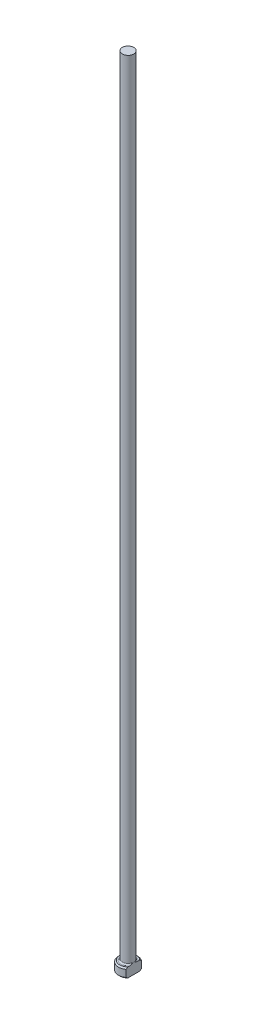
ISO-10303-21;
HEADER;
FILE_DESCRIPTION(('STEP AP214'),'2;1');
FILE_NAME('part.step','',(''),(''),'','','');
FILE_SCHEMA(('AUTOMOTIVE_DESIGN { 1 0 10303 214 1 1 1 1 }'));
ENDSEC;
DATA;
#1=APPLICATION_CONTEXT('core data for automotive mechanical design processes');
#2=APPLICATION_PROTOCOL_DEFINITION('international standard','automotive_design',2000,#1);
#3=PRODUCT_CONTEXT('',#1,'mechanical');
#4=PRODUCT('Part','Part','',(#3));
#5=PRODUCT_RELATED_PRODUCT_CATEGORY('part','',(#4));
#6=PRODUCT_DEFINITION_FORMATION('','',#4);
#7=PRODUCT_DEFINITION_CONTEXT('part definition',#1,'design');
#8=PRODUCT_DEFINITION('design','',#6,#7);
#9=PRODUCT_DEFINITION_SHAPE('','',#8);
#10=(LENGTH_UNIT() NAMED_UNIT(*) SI_UNIT(.MILLI.,.METRE.));
#11=(NAMED_UNIT(*) PLANE_ANGLE_UNIT() SI_UNIT($,.RADIAN.));
#12=(NAMED_UNIT(*) SI_UNIT($,.STERADIAN.) SOLID_ANGLE_UNIT());
#13=UNCERTAINTY_MEASURE_WITH_UNIT(LENGTH_MEASURE(1.E-05),#10,'distance_accuracy_value','');
#14=(GEOMETRIC_REPRESENTATION_CONTEXT(3) GLOBAL_UNCERTAINTY_ASSIGNED_CONTEXT((#13)) GLOBAL_UNIT_ASSIGNED_CONTEXT((#10,
#11,#12)) REPRESENTATION_CONTEXT('',''));
#15=CARTESIAN_POINT('',(0.,0.,0.));
#16=DIRECTION('',(0.,0.,1.));
#17=DIRECTION('',(1.,0.,0.));
#18=AXIS2_PLACEMENT_3D('',#15,#16,#17);
#19=CARTESIAN_POINT('',(0.,0.,0.));
#20=DIRECTION('',(0.,-1.,0.));
#21=DIRECTION('',(0.,0.,-1.));
#22=AXIS2_PLACEMENT_3D('',#19,#20,#21);
#23=PLANE('',#22);
#24=CARTESIAN_POINT('',(0.,0.,0.));
#25=DIRECTION('',(0.,-1.,0.));
#26=DIRECTION('',(0.,0.,-1.));
#27=AXIS2_PLACEMENT_3D('',#24,#25,#26);
#28=CIRCLE('',#27,1.29999999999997);
#29=CARTESIAN_POINT('',(0.899999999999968,0.,0.938083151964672));
#30=VERTEX_POINT('',#29);
#31=CARTESIAN_POINT('',(0.899999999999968,0.,-0.938083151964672));
#32=VERTEX_POINT('',#31);
#33=EDGE_CURVE('E98',#30,#32,#28,.T.);
#34=ORIENTED_EDGE('',*,*,#33,.T.);
#35=DIRECTION('',(0.,0.,1.));
#36=VECTOR('',#35,1.);
#37=CARTESIAN_POINT('',(0.899999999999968,0.,-1.19999999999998));
#38=LINE('',#37,#36);
#39=EDGE_CURVE('E83',#32,#30,#38,.T.);
#40=ORIENTED_EDGE('',*,*,#39,.T.);
#41=EDGE_LOOP('',(#34,#40));
#42=FACE_BOUND('',#41,.T.);
#43=ADVANCED_FACE('F32',(#42),#23,.T.);
#44=CARTESIAN_POINT('',(0.,259.958771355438,0.));
#45=DIRECTION('',(0.,1.,0.));
#46=DIRECTION('',(0.,0.,1.));
#47=AXIS2_PLACEMENT_3D('',#44,#45,#46);
#48=CYLINDRICAL_SURFACE('',#47,1.49999999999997);
#49=CARTESIAN_POINT('',(0.,1.29999999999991,0.));
#50=DIRECTION('',(0.,1.,0.));
#51=DIRECTION('',(0.,0.,1.));
#52=AXIS2_PLACEMENT_3D('',#49,#50,#51);
#53=CIRCLE('',#52,1.49999999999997);
#54=CARTESIAN_POINT('',(0.899999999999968,1.29999999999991,1.19999999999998));
#55=VERTEX_POINT('',#54);
#56=CARTESIAN_POINT('',(0.899999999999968,1.29999999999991,-1.19999999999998));
#57=VERTEX_POINT('',#56);
#58=EDGE_CURVE('E104',#55,#57,#53,.F.);
#59=ORIENTED_EDGE('',*,*,#58,.T.);
#60=DIRECTION('',(0.,-1.,0.));
#61=VECTOR('',#60,1.);
#62=CARTESIAN_POINT('',(0.899999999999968,125.,-1.19999999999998));
#63=LINE('',#62,#61);
#64=CARTESIAN_POINT('',(0.899999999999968,0.200000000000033,-1.19999999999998));
#65=VERTEX_POINT('',#64);
#66=EDGE_CURVE('E183',#57,#65,#63,.T.);
#67=ORIENTED_EDGE('',*,*,#66,.T.);
#68=CARTESIAN_POINT('',(0.,0.200000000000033,0.));
#69=DIRECTION('',(0.,-1.,0.));
#70=DIRECTION('',(0.,0.,-1.));
#71=AXIS2_PLACEMENT_3D('',#68,#69,#70);
#72=CIRCLE('',#71,1.49999999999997);
#73=CARTESIAN_POINT('',(0.899999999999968,0.200000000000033,1.19999999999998));
#74=VERTEX_POINT('',#73);
#75=EDGE_CURVE('E100',#65,#74,#72,.F.);
#76=ORIENTED_EDGE('',*,*,#75,.T.);
#77=DIRECTION('',(0.,-1.,0.));
#78=VECTOR('',#77,1.);
#79=CARTESIAN_POINT('',(0.899999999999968,125.,1.19999999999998));
#80=LINE('',#79,#78);
#81=EDGE_CURVE('E93',#55,#74,#80,.T.);
#82=ORIENTED_EDGE('',*,*,#81,.F.);
#83=EDGE_LOOP('',(#59,#67,#76,#82));
#84=FACE_BOUND('',#83,.T.);
#85=ADVANCED_FACE('F158',(#84),#48,.T.);
#86=CARTESIAN_POINT('',(-1.49999999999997,1.5,0.));
#87=DIRECTION('',(0.,1.,0.));
#88=DIRECTION('',(0.,0.,1.));
#89=AXIS2_PLACEMENT_3D('',#86,#87,#88);
#90=PLANE('',#89);
#91=CARTESIAN_POINT('',(0.,1.5,0.));
#92=DIRECTION('',(0.,1.,0.));
#93=DIRECTION('',(0.,0.,1.));
#94=AXIS2_PLACEMENT_3D('',#91,#92,#93);
#95=CIRCLE('',#94,1.29999999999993);
#96=CARTESIAN_POINT('',(0.899999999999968,1.5,-0.938083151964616));
#97=VERTEX_POINT('',#96);
#98=CARTESIAN_POINT('',(0.899999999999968,1.5,0.938083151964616));
#99=VERTEX_POINT('',#98);
#100=EDGE_CURVE('E178',#97,#99,#95,.T.);
#101=ORIENTED_EDGE('',*,*,#100,.T.);
#102=DIRECTION('',(0.,0.,-1.));
#103=VECTOR('',#102,1.);
#104=CARTESIAN_POINT('',(0.899999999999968,1.5,0.));
#105=LINE('',#104,#103);
#106=CARTESIAN_POINT('',(0.899999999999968,1.49999999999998,0.632455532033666));
#107=VERTEX_POINT('',#106);
#108=EDGE_CURVE('E57',#99,#107,#105,.T.);
#109=ORIENTED_EDGE('',*,*,#108,.T.);
#110=CARTESIAN_POINT('',(0.,1.5,0.));
#111=DIRECTION('',(0.,1.,0.));
#112=DIRECTION('',(0.,0.,1.));
#113=AXIS2_PLACEMENT_3D('',#110,#111,#112);
#114=CIRCLE('',#113,1.09999999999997);
#115=CARTESIAN_POINT('',(0.899999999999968,1.49999999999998,-0.632455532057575));
#116=VERTEX_POINT('',#115);
#117=EDGE_CURVE('E107',#107,#116,#114,.F.);
#118=ORIENTED_EDGE('',*,*,#117,.T.);
#119=EDGE_CURVE('E136',#116,#97,#105,.T.);
#120=ORIENTED_EDGE('',*,*,#119,.T.);
#121=EDGE_LOOP('',(#101,#109,#118,#120));
#122=FACE_BOUND('',#121,.T.);
#123=ADVANCED_FACE('F147',(#122),#90,.T.);
#124=CARTESIAN_POINT('',(0.,1.5,0.));
#125=DIRECTION('',(0.,-1.,0.));
#126=DIRECTION('',(0.,0.,-1.));
#127=AXIS2_PLACEMENT_3D('',#124,#125,#126);
#128=CONICAL_SURFACE('',#127,1.29999999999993,0.785398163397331);
#129=ORIENTED_EDGE('',*,*,#58,.F.);
#130=CARTESIAN_POINT('',(0.899999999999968,0.00589240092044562,2.64519134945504));
#131=CARTESIAN_POINT('',(0.899999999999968,0.0875935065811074,2.55886544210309));
#132=CARTESIAN_POINT('',(0.899999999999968,0.169100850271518,2.47235390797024));
#133=CARTESIAN_POINT('',(0.899999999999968,0.331616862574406,2.29867113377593));
#134=CARTESIAN_POINT('',(0.899999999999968,0.412624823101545,2.21149923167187));
#135=CARTESIAN_POINT('',(0.899999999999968,0.577358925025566,2.03258511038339));
#136=CARTESIAN_POINT('',(0.899999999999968,0.661049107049,1.94080967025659));
#137=CARTESIAN_POINT('',(0.899999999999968,0.827038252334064,1.75619257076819));
#138=CARTESIAN_POINT('',(0.899999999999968,0.909338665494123,1.66335221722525));
#139=CARTESIAN_POINT('',(0.899999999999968,1.07183067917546,1.47606416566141));
#140=CARTESIAN_POINT('',(0.899999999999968,1.15202519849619,1.38161902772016));
#141=CARTESIAN_POINT('',(0.899999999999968,1.26992152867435,1.237694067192));
#142=CARTESIAN_POINT('',(0.899999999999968,1.30888905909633,1.18925359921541));
#143=CARTESIAN_POINT('',(0.899999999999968,1.38565831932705,1.09146009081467));
#144=CARTESIAN_POINT('',(0.899999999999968,1.42346015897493,1.04210713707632));
#145=CARTESIAN_POINT('',(0.899999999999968,1.49668885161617,0.943239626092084));
#146=CARTESIAN_POINT('',(0.899999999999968,1.53214870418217,0.893749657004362));
#147=CARTESIAN_POINT('',(0.899999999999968,1.60090132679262,0.793212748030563));
#148=CARTESIAN_POINT('',(0.899999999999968,1.63419242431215,0.742164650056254));
#149=CARTESIAN_POINT('',(0.899999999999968,1.69733745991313,0.638399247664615));
#150=CARTESIAN_POINT('',(0.899999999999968,1.72721157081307,0.585694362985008));
#151=CARTESIAN_POINT('',(0.899999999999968,1.78207526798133,0.477828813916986));
#152=CARTESIAN_POINT('',(0.899999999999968,1.80707433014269,0.422673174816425));
#153=CARTESIAN_POINT('',(0.899999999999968,1.83835305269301,0.339650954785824));
#154=CARTESIAN_POINT('',(0.899999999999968,1.84751725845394,0.312872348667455));
#155=CARTESIAN_POINT('',(0.899999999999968,1.86390997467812,0.258710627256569));
#156=CARTESIAN_POINT('',(0.899999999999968,1.87113784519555,0.231327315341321));
#157=CARTESIAN_POINT('',(0.899999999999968,1.88330445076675,0.17620583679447));
#158=CARTESIAN_POINT('',(0.899999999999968,1.88825539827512,0.148470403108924));
#159=CARTESIAN_POINT('',(0.899999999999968,1.89566404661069,0.0926697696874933));
#160=CARTESIAN_POINT('',(0.899999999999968,1.89812233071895,0.0646046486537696));
#161=CARTESIAN_POINT('',(0.899999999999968,1.9004068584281,0.00817656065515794));
#162=CARTESIAN_POINT('',(0.899999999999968,1.90021541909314,-0.0201871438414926));
#163=CARTESIAN_POINT('',(0.899999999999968,1.89717544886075,-0.0767648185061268));
#164=CARTESIAN_POINT('',(0.899999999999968,1.89432689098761,-0.104978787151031));
#165=CARTESIAN_POINT('',(0.899999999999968,1.88198440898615,-0.189311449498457));
#166=CARTESIAN_POINT('',(0.899999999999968,1.86868632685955,-0.244892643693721));
#167=CARTESIAN_POINT('',(0.899999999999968,1.83784085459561,-0.342756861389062));
#168=CARTESIAN_POINT('',(0.899999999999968,1.82164970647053,-0.385499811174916));
#169=CARTESIAN_POINT('',(0.899999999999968,1.78562895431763,-0.469449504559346));
#170=CARTESIAN_POINT('',(0.899999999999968,1.76579631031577,-0.510654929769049));
#171=CARTESIAN_POINT('',(0.899999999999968,1.7232927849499,-0.592044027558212));
#172=CARTESIAN_POINT('',(0.899999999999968,1.70059692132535,-0.632214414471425));
#173=CARTESIAN_POINT('',(0.899999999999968,1.65325605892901,-0.711354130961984));
#174=CARTESIAN_POINT('',(0.899999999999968,1.62861192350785,-0.750323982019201));
#175=CARTESIAN_POINT('',(0.899999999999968,1.57369928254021,-0.833637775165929));
#176=CARTESIAN_POINT('',(0.899999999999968,1.5431726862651,-0.877810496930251));
#177=CARTESIAN_POINT('',(0.899999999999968,1.48069350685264,-0.965139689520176));
#178=CARTESIAN_POINT('',(0.899999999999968,1.4487406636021,-1.00829597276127));
#179=CARTESIAN_POINT('',(0.899999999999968,1.35127693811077,-1.13662989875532));
#180=CARTESIAN_POINT('',(0.899999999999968,1.28420052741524,-1.22061473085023));
#181=CARTESIAN_POINT('',(0.899999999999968,1.14740677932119,-1.3868192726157));
#182=CARTESIAN_POINT('',(0.899999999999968,1.07768177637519,-1.46903257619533));
#183=CARTESIAN_POINT('',(0.899999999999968,0.936682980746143,-1.632060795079));
#184=CARTESIAN_POINT('',(0.899999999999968,0.865409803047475,-1.71287624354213));
#185=CARTESIAN_POINT('',(0.899999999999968,0.728966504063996,-1.86553619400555));
#186=CARTESIAN_POINT('',(0.899999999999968,0.66389711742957,-1.93747112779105));
#187=CARTESIAN_POINT('',(0.899999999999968,0.533118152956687,-2.08077158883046));
#188=CARTESIAN_POINT('',(0.899999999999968,0.467408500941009,-2.15213704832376));
#189=CARTESIAN_POINT('',(0.899999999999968,0.335929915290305,-2.29398062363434));
#190=CARTESIAN_POINT('',(0.899999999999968,0.270163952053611,-2.36446149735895));
#191=CARTESIAN_POINT('',(0.899999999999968,0.138274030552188,-2.50506786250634));
#192=CARTESIAN_POINT('',(0.899999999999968,0.0721501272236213,-2.57519340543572));
#193=CARTESIAN_POINT('',(0.899999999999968,0.00589240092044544,-2.64519134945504));
#194=B_SPLINE_CURVE_WITH_KNOTS('',3,(#130,#131,#132,#133,#134,#135,#136,#137,#138,#139,#140,
#141,#142,#143,#144,#145,#146,#147,#148,#149,#150,#151,#152,#153,#154,#155,#156,#157,#158,#159,
#160,#161,#162,#163,#164,#165,#166,#167,#168,#169,#170,#171,#172,#173,#174,#175,#176,#177,#178,
#179,#180,#181,#182,#183,#184,#185,#186,#187,#188,#189,#190,#191,#192,#193),.UNSPECIFIED.,.F.,
.F.,(4,2,2,2,2,2,2,2,2,2,2,2,2,2,2,2,2,2,2,2,2,2,2,2,2,2,2,2,2,2,2,4),(0.,0.356576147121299,
0.713576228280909,1.08618079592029,1.45836906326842,1.83001087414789,2.01650462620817,
2.20298075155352,2.38558873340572,2.56833591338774,2.74994146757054,2.93119042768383,
3.01604159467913,3.10092076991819,3.18533922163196,3.26973791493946,3.3547001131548,
3.43966317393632,3.61026391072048,3.74720161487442,3.8842541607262,4.02259807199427,
4.16088101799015,4.32192495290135,4.48299837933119,4.80535548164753,5.12872978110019,
5.4519778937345,5.7429683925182,6.03399301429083,6.32318782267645,6.61233943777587),.UNSPECIFIED.);
#195=EDGE_CURVE('E135',#55,#99,#194,.T.);
#196=ORIENTED_EDGE('',*,*,#195,.T.);
#197=ORIENTED_EDGE('',*,*,#100,.F.);
#198=EDGE_CURVE('E127',#97,#57,#194,.T.);
#199=ORIENTED_EDGE('',*,*,#198,.T.);
#200=EDGE_LOOP('',(#129,#196,#197,#199));
#201=FACE_BOUND('',#200,.T.);
#202=ADVANCED_FACE('F143',(#201),#128,.T.);
#203=CARTESIAN_POINT('',(0.,0.200000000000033,0.));
#204=DIRECTION('',(0.,1.,0.));
#205=DIRECTION('',(0.,0.,1.));
#206=AXIS2_PLACEMENT_3D('',#203,#204,#205);
#207=CONICAL_SURFACE('',#206,1.49999999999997,0.785398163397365);
#208=ORIENTED_EDGE('',*,*,#75,.F.);
#209=CARTESIAN_POINT('',(0.899999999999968,1.49410759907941,-2.64519134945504));
#210=CARTESIAN_POINT('',(0.899999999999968,1.41240649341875,-2.55886544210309));
#211=CARTESIAN_POINT('',(0.899999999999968,1.33089914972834,-2.47235390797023));
#212=CARTESIAN_POINT('',(0.899999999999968,1.16838313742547,-2.29867113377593));
#213=CARTESIAN_POINT('',(0.899999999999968,1.08737517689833,-2.21149923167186));
#214=CARTESIAN_POINT('',(0.899999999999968,0.922641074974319,-2.03258511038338));
#215=CARTESIAN_POINT('',(0.899999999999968,0.838950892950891,-1.94080967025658));
#216=CARTESIAN_POINT('',(0.899999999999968,0.672961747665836,-1.75619257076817));
#217=CARTESIAN_POINT('',(0.899999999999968,0.590661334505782,-1.66335221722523));
#218=CARTESIAN_POINT('',(0.899999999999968,0.428169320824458,-1.4760641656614));
#219=CARTESIAN_POINT('',(0.899999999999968,0.347974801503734,-1.38161902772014));
#220=CARTESIAN_POINT('',(0.899999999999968,0.230078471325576,-1.23769406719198));
#221=CARTESIAN_POINT('',(0.899999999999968,0.1911109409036,-1.18925359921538));
#222=CARTESIAN_POINT('',(0.899999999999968,0.114341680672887,-1.09146009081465));
#223=CARTESIAN_POINT('',(0.899999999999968,0.0765398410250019,-1.04210713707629));
#224=CARTESIAN_POINT('',(0.899999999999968,0.00331114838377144,-0.943239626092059));
#225=CARTESIAN_POINT('',(0.899999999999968,-0.0321487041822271,-0.893749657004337));
#226=CARTESIAN_POINT('',(0.899999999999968,-0.100901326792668,-0.793212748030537));
#227=CARTESIAN_POINT('',(0.899999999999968,-0.134192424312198,-0.742164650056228));
#228=CARTESIAN_POINT('',(0.899999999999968,-0.197337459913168,-0.638399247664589));
#229=CARTESIAN_POINT('',(0.899999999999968,-0.227211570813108,-0.585694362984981));
#230=CARTESIAN_POINT('',(0.899999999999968,-0.28207526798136,-0.477828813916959));
#231=CARTESIAN_POINT('',(0.899999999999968,-0.307074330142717,-0.422673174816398));
#232=CARTESIAN_POINT('',(0.899999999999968,-0.338353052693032,-0.339650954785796));
#233=CARTESIAN_POINT('',(0.899999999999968,-0.347517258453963,-0.312872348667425));
#234=CARTESIAN_POINT('',(0.899999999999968,-0.363909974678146,-0.258710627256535));
#235=CARTESIAN_POINT('',(0.899999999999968,-0.371137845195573,-0.231327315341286));
#236=CARTESIAN_POINT('',(0.899999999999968,-0.383304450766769,-0.176205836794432));
#237=CARTESIAN_POINT('',(0.899999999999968,-0.388255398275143,-0.148470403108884));
#238=CARTESIAN_POINT('',(0.899999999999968,-0.395664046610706,-0.0926697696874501));
#239=CARTESIAN_POINT('',(0.899999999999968,-0.398122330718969,-0.064604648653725));
#240=CARTESIAN_POINT('',(0.899999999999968,-0.400406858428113,-0.00817656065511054));
#241=CARTESIAN_POINT('',(0.899999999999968,-0.400215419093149,0.0201871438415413));
#242=CARTESIAN_POINT('',(0.899999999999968,-0.397175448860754,0.0767648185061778));
#243=CARTESIAN_POINT('',(0.899999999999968,-0.394326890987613,0.104978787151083));
#244=CARTESIAN_POINT('',(0.899999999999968,-0.381984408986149,0.189311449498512));
#245=CARTESIAN_POINT('',(0.899999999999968,-0.368686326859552,0.244892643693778));
#246=CARTESIAN_POINT('',(0.899999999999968,-0.337840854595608,0.342756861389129));
#247=CARTESIAN_POINT('',(0.899999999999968,-0.321649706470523,0.38549981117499));
#248=CARTESIAN_POINT('',(0.899999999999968,-0.285628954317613,0.469449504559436));
#249=CARTESIAN_POINT('',(0.899999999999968,-0.26579631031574,0.510654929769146));
#250=CARTESIAN_POINT('',(0.899999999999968,-0.22329278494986,0.592044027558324));
#251=CARTESIAN_POINT('',(0.899999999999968,-0.20059692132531,0.632214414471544));
#252=CARTESIAN_POINT('',(0.899999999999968,-0.153256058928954,0.711354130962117));
#253=CARTESIAN_POINT('',(0.899999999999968,-0.128611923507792,0.75032398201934));
#254=CARTESIAN_POINT('',(0.899999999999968,-0.0736992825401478,0.83363777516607));
#255=CARTESIAN_POINT('',(0.899999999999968,-0.0431726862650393,0.877810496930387));
#256=CARTESIAN_POINT('',(0.899999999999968,0.0193064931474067,0.9651396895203));
#257=CARTESIAN_POINT('',(0.899999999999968,0.0512593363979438,1.00829597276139));
#258=CARTESIAN_POINT('',(0.899999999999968,0.148723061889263,1.13662989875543));
#259=CARTESIAN_POINT('',(0.899999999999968,0.215799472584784,1.22061473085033));
#260=CARTESIAN_POINT('',(0.899999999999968,0.352593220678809,1.38681927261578));
#261=CARTESIAN_POINT('',(0.899999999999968,0.422318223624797,1.46903257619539));
#262=CARTESIAN_POINT('',(0.899999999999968,0.563317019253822,1.63206079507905));
#263=CARTESIAN_POINT('',(0.899999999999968,0.634590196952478,1.71287624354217));
#264=CARTESIAN_POINT('',(0.899999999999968,0.771033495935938,1.86553619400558));
#265=CARTESIAN_POINT('',(0.899999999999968,0.836102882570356,1.93747112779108));
#266=CARTESIAN_POINT('',(0.899999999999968,0.966881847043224,2.08077158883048));
#267=CARTESIAN_POINT('',(0.899999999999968,1.0325914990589,2.15213704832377));
#268=CARTESIAN_POINT('',(0.899999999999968,1.16407008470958,2.29398062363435));
#269=CARTESIAN_POINT('',(0.899999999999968,1.22983604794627,2.36446149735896));
#270=CARTESIAN_POINT('',(0.899999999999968,1.36172596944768,2.50506786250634));
#271=CARTESIAN_POINT('',(0.899999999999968,1.42784987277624,2.57519340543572));
#272=CARTESIAN_POINT('',(0.899999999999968,1.49410759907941,2.64519134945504));
#273=B_SPLINE_CURVE_WITH_KNOTS('',3,(#209,#210,#211,#212,#213,#214,#215,#216,#217,#218,#219,
#220,#221,#222,#223,#224,#225,#226,#227,#228,#229,#230,#231,#232,#233,#234,#235,#236,#237,#238,
#239,#240,#241,#242,#243,#244,#245,#246,#247,#248,#249,#250,#251,#252,#253,#254,#255,#256,#257,
#258,#259,#260,#261,#262,#263,#264,#265,#266,#267,#268,#269,#270,#271,#272),.UNSPECIFIED.,.F.,
.F.,(4,2,2,2,2,2,2,2,2,2,2,2,2,2,2,2,2,2,2,2,2,2,2,2,2,2,2,2,2,2,2,4),(0.,0.356576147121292,
0.713576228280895,1.08618079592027,1.45836906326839,1.83001087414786,2.01650462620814,
2.20298075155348,2.38558873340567,2.56833591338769,2.74994146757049,2.93119042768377,
3.01604159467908,3.10092076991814,3.18533922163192,3.26973791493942,3.35470011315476,
3.43966317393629,3.61026391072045,3.74720161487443,3.88425416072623,4.02259807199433,
4.16088101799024,4.32192495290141,4.48299837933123,4.80535548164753,5.12872978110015,
5.45197789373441,5.74296839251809,6.0339930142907,6.3231878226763,6.6123394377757),.UNSPECIFIED.);
#274=EDGE_CURVE('E86',#65,#32,#273,.T.);
#275=ORIENTED_EDGE('',*,*,#274,.T.);
#276=ORIENTED_EDGE('',*,*,#33,.F.);
#277=EDGE_CURVE('E89',#30,#74,#273,.T.);
#278=ORIENTED_EDGE('',*,*,#277,.T.);
#279=EDGE_LOOP('',(#208,#275,#276,#278));
#280=FACE_BOUND('',#279,.T.);
#281=ADVANCED_FACE('F97',(#280),#207,.T.);
#282=CARTESIAN_POINT('',(0.,1.69999999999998,0.));
#283=DIRECTION('',(0.,1.,0.));
#284=DIRECTION('',(0.,0.,1.));
#285=AXIS2_PLACEMENT_3D('',#282,#283,#284);
#286=TOROIDAL_SURFACE('',#285,1.09999999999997,0.2);
#287=CARTESIAN_POINT('',(0.899999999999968,1.69999999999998,0.));
#288=CARTESIAN_POINT('',(0.899999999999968,1.70000051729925,-4.81752855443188E-12));
#289=CARTESIAN_POINT('',(0.899999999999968,1.70000103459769,-8.83853827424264E-08));
#290=CARTESIAN_POINT('',(0.899999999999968,1.70000203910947,-3.79347123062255E-07));
#291=CARTESIAN_POINT('',(0.899999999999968,1.70000252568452,-5.83791020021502E-07));
#292=CARTESIAN_POINT('',(0.899999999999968,1.70000349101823,-1.07888050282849E-06));
#293=CARTESIAN_POINT('',(0.899999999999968,1.70000396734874,-1.37414928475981E-06));
#294=CARTESIAN_POINT('',(0.899999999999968,1.70000487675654,-2.01876645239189E-06));
#295=CARTESIAN_POINT('',(0.899999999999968,1.70000531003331,-2.36784425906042E-06));
#296=CARTESIAN_POINT('',(0.899999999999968,1.70000672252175,-3.59471376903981E-06));
#297=CARTESIAN_POINT('',(0.899999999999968,1.70000764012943,-4.54411385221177E-06));
#298=CARTESIAN_POINT('',(0.899999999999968,1.70000930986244,-6.53225285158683E-06));
#299=CARTESIAN_POINT('',(0.899999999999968,1.70001006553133,-7.56818772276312E-06));
#300=CARTESIAN_POINT('',(0.899999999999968,1.70001280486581,-1.1504277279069E-05));
#301=CARTESIAN_POINT('',(0.899999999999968,1.70001463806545,-1.45126261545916E-05));
#302=CARTESIAN_POINT('',(0.899999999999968,1.70001772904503,-2.0529366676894E-05));
#303=CARTESIAN_POINT('',(0.899999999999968,1.7000190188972,-2.35219566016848E-05));
#304=CARTESIAN_POINT('',(0.899999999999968,1.70002431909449,-3.59579086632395E-05));
#305=CARTESIAN_POINT('',(0.899999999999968,1.70002821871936,-4.5443001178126E-05));
#306=CARTESIAN_POINT('',(0.899999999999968,1.70003465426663,-6.33834857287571E-05));
#307=CARTESIAN_POINT('',(0.899999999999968,1.70003730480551,-7.17963379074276E-05));
#308=CARTESIAN_POINT('',(0.899999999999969,1.7000577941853,-0.000131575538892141));
#309=CARTESIAN_POINT('',(0.899999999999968,1.70008325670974,-0.000179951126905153));
#310=CARTESIAN_POINT('',(0.899999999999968,1.70017756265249,-0.000366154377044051));
#311=CARTESIAN_POINT('',(0.899999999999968,1.70024074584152,-0.000506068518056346));
#312=CARTESIAN_POINT('',(0.899999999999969,1.70048673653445,-0.00104250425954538));
#313=CARTESIAN_POINT('',(0.899999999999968,1.70067547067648,-0.00143687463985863));
#314=CARTESIAN_POINT('',(0.899999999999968,1.70143326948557,-0.00302835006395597));
#315=CARTESIAN_POINT('',(0.899999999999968,1.70199567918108,-0.004227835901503));
#316=CARTESIAN_POINT('',(0.899999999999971,1.71027509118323,-0.0218760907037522));
#317=CARTESIAN_POINT('',(0.899999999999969,1.71804211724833,-0.0383074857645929));
#318=CARTESIAN_POINT('',(0.899999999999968,1.73319280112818,-0.070653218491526));
#319=CARTESIAN_POINT('',(0.899999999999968,1.740580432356,-0.0865658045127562));
#320=CARTESIAN_POINT('',(0.899999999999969,1.75601133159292,-0.120208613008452));
#321=CARTESIAN_POINT('',(0.899999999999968,1.76403763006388,-0.137946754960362));
#322=CARTESIAN_POINT('',(0.899999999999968,1.77987044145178,-0.173723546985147));
#323=CARTESIAN_POINT('',(0.899999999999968,1.78767412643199,-0.19176344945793));
#324=CARTESIAN_POINT('',(0.899999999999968,1.80675241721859,-0.237275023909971));
#325=CARTESIAN_POINT('',(0.899999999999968,1.81776430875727,-0.2648584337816));
#326=CARTESIAN_POINT('',(0.899999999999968,1.83819603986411,-0.319948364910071));
#327=CARTESIAN_POINT('',(0.899999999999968,1.84764487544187,-0.347443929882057));
#328=CARTESIAN_POINT('',(0.899999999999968,1.86148320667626,-0.392411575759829));
#329=CARTESIAN_POINT('',(0.899999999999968,1.86642863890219,-0.409710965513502));
#330=CARTESIAN_POINT('',(0.899999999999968,1.8755120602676,-0.444608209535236));
#331=CARTESIAN_POINT('',(0.899999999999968,1.87964591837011,-0.462207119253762));
#332=CARTESIAN_POINT('',(0.899999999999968,1.89092217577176,-0.517069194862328));
#333=CARTESIAN_POINT('',(0.899999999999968,1.89638973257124,-0.554723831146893));
#334=CARTESIAN_POINT('',(0.899999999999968,1.90033616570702,-0.618345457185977));
#335=CARTESIAN_POINT('',(0.899999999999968,1.90048945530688,-0.644204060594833));
#336=CARTESIAN_POINT('',(0.899999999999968,1.89710720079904,-0.695408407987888));
#337=CARTESIAN_POINT('',(0.899999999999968,1.89361956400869,-0.720756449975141));
#338=CARTESIAN_POINT('',(0.899999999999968,1.8840925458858,-0.761575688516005));
#339=CARTESIAN_POINT('',(0.899999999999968,1.87939871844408,-0.77735842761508));
#340=CARTESIAN_POINT('',(0.899999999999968,1.8677590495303,-0.808125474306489));
#341=CARTESIAN_POINT('',(0.899999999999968,1.86081090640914,-0.82310894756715));
#342=CARTESIAN_POINT('',(0.899999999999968,1.84643118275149,-0.84802158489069));
#343=CARTESIAN_POINT('',(0.899999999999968,1.83956190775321,-0.858273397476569));
#344=CARTESIAN_POINT('',(0.899999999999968,1.82429709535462,-0.877569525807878));
#345=CARTESIAN_POINT('',(0.899999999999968,1.81590447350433,-0.886616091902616));
#346=CARTESIAN_POINT('',(0.899999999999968,1.79958050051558,-0.90122933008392));
#347=CARTESIAN_POINT('',(0.899999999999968,1.79194496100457,-0.907125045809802));
#348=CARTESIAN_POINT('',(0.899999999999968,1.77580769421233,-0.917595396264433));
#349=CARTESIAN_POINT('',(0.899999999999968,1.76730630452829,-0.922170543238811));
#350=CARTESIAN_POINT('',(0.899999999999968,1.74953707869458,-0.929743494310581));
#351=CARTESIAN_POINT('',(0.899999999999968,1.7402636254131,-0.932728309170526));
#352=CARTESIAN_POINT('',(0.899999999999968,1.72131152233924,-0.936825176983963));
#353=CARTESIAN_POINT('',(0.899999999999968,1.71163321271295,-0.937938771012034));
#354=CARTESIAN_POINT('',(0.899999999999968,1.69353224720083,-0.938184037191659));
#355=CARTESIAN_POINT('',(0.899999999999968,1.68511203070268,-0.937557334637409));
#356=CARTESIAN_POINT('',(0.899999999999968,1.66850650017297,-0.934868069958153));
#357=CARTESIAN_POINT('',(0.899999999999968,1.66032116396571,-0.932805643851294));
#358=CARTESIAN_POINT('',(0.899999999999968,1.64454784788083,-0.927423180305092));
#359=CARTESIAN_POINT('',(0.899999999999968,1.63695168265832,-0.924126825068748));
#360=CARTESIAN_POINT('',(0.899999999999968,1.62233604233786,-0.916445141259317));
#361=CARTESIAN_POINT('',(0.899999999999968,1.61531677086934,-0.912059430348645));
#362=CARTESIAN_POINT('',(0.899999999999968,1.59928568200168,-0.90046071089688));
#363=CARTESIAN_POINT('',(0.899999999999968,1.59058572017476,-0.892815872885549));
#364=CARTESIAN_POINT('',(0.899999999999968,1.5745385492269,-0.876213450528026));
#365=CARTESIAN_POINT('',(0.899999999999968,1.56719456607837,-0.867252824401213));
#366=CARTESIAN_POINT('',(0.899999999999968,1.55118133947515,-0.84466452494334));
#367=CARTESIAN_POINT('',(0.899999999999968,1.54313909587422,-0.830593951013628));
#368=CARTESIAN_POINT('',(0.899999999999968,1.52938683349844,-0.801407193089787));
#369=CARTESIAN_POINT('',(0.899999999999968,1.5236756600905,-0.786291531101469));
#370=CARTESIAN_POINT('',(0.899999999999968,1.51172911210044,-0.74718638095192));
#371=CARTESIAN_POINT('',(0.899999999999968,1.50685445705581,-0.722784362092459));
#372=CARTESIAN_POINT('',(0.899999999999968,1.50081074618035,-0.673272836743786));
#373=CARTESIAN_POINT('',(0.899999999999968,1.49969151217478,-0.648158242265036));
#374=CARTESIAN_POINT('',(0.899999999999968,1.50075906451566,-0.577783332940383));
#375=CARTESIAN_POINT('',(0.899999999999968,1.50633248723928,-0.532580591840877));
#376=CARTESIAN_POINT('',(0.899999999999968,1.51921661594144,-0.466989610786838));
#377=CARTESIAN_POINT('',(0.899999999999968,1.52408424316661,-0.446017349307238));
#378=CARTESIAN_POINT('',(0.899999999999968,1.53497010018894,-0.404492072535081));
#379=CARTESIAN_POINT('',(0.899999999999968,1.54098157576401,-0.383937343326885));
#380=CARTESIAN_POINT('',(0.899999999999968,1.55597324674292,-0.336733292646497));
#381=CARTESIAN_POINT('',(0.899999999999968,1.56529325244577,-0.31019400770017));
#382=CARTESIAN_POINT('',(0.899999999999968,1.58534056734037,-0.256981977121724));
#383=CARTESIAN_POINT('',(0.899999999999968,1.59609461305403,-0.230319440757));
#384=CARTESIAN_POINT('',(0.899999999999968,1.61469335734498,-0.186260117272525));
#385=CARTESIAN_POINT('',(0.899999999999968,1.62230075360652,-0.168761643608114));
#386=CARTESIAN_POINT('',(0.899999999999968,1.63771739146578,-0.134051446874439));
#387=CARTESIAN_POINT('',(0.899999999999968,1.64552404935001,-0.11683857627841));
#388=CARTESIAN_POINT('',(0.899999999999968,1.66052241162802,-0.0841876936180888));
#389=CARTESIAN_POINT('',(0.899999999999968,1.66769861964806,-0.068742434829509));
#390=CARTESIAN_POINT('',(0.899999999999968,1.68241091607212,-0.0373451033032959));
#391=CARTESIAN_POINT('',(0.899999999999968,1.68995069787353,-0.0213946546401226));
#392=CARTESIAN_POINT('',(0.899999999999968,1.69800429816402,-0.00422789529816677));
#393=CARTESIAN_POINT('',(0.899999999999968,1.6985666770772,-0.00302846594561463));
#394=CARTESIAN_POINT('',(0.899999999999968,1.69932446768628,-0.00143700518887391));
#395=CARTESIAN_POINT('',(0.899999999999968,1.69951322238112,-0.001042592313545));
#396=CARTESIAN_POINT('',(0.899999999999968,1.69975923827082,-0.0005061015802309));
#397=CARTESIAN_POINT('',(0.899999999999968,1.69982242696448,-0.00036617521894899));
#398=CARTESIAN_POINT('',(0.899999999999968,1.69991674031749,-0.000179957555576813));
#399=CARTESIAN_POINT('',(0.899999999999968,1.69994220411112,-0.000131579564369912));
#400=CARTESIAN_POINT('',(0.899999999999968,1.69996269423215,-7.17975508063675E-05));
#401=CARTESIAN_POINT('',(0.899999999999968,1.69996534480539,-6.33844949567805E-05));
#402=CARTESIAN_POINT('',(0.899999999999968,1.69997178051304,-4.54435728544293E-05));
#403=CARTESIAN_POINT('',(0.899999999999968,1.69997568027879,-3.59582518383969E-05));
#404=CARTESIAN_POINT('',(0.899999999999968,1.69998098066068,-2.35220424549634E-05));
#405=CARTESIAN_POINT('',(0.899999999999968,1.69998227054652,-2.05294182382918E-05));
#406=CARTESIAN_POINT('',(0.899999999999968,1.69998536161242,-1.45126147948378E-05));
#407=CARTESIAN_POINT('',(0.899999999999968,1.69998719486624,-1.15042383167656E-05));
#408=CARTESIAN_POINT('',(0.899999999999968,1.69998993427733,-7.56812363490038E-06));
#409=CARTESIAN_POINT('',(0.899999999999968,1.69999068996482,-6.53218593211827E-06));
#410=CARTESIAN_POINT('',(0.899999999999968,1.69999235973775,-4.54404507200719E-06));
#411=CARTESIAN_POINT('',(0.899999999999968,1.69999327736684,-3.59464609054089E-06));
#412=CARTESIAN_POINT('',(0.899999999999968,1.69999468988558,-2.367782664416E-06));
#413=CARTESIAN_POINT('',(0.899999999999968,1.69999512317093,-2.0187075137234E-06));
#414=CARTESIAN_POINT('',(0.899999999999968,1.6999960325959,-1.37409717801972E-06));
#415=CARTESIAN_POINT('',(0.899999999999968,1.69999650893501,-1.07883258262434E-06));
#416=CARTESIAN_POINT('',(0.899999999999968,1.69999747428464,-5.83753284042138E-07));
#417=CARTESIAN_POINT('',(0.899999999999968,1.69999796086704,-3.79315230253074E-07));
#418=CARTESIAN_POINT('',(0.899999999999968,1.69999896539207,-8.83675723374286E-08));
#419=CARTESIAN_POINT('',(0.899999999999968,1.69999948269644,4.81756834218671E-12));
#420=CARTESIAN_POINT('',(0.899999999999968,1.69999999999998,0.));
#421=B_SPLINE_CURVE_WITH_KNOTS('',3,(#287,#288,#289,#290,#291,#292,#293,#294,#295,#296,#297,
#298,#299,#300,#301,#302,#303,#304,#305,#306,#307,#308,#309,#310,#311,#312,#313,#314,#315,#316,
#317,#318,#319,#320,#321,#322,#323,#324,#325,#326,#327,#328,#329,#330,#331,#332,#333,#334,#335,
#336,#337,#338,#339,#340,#341,#342,#343,#344,#345,#346,#347,#348,#349,#350,#351,#352,#353,#354,
#355,#356,#357,#358,#359,#360,#361,#362,#363,#364,#365,#366,#367,#368,#369,#370,#371,#372,#373,
#374,#375,#376,#377,#378,#379,#380,#381,#382,#383,#384,#385,#386,#387,#388,#389,#390,#391,#392,
#393,#394,#395,#396,#397,#398,#399,#400,#401,#402,#403,#404,#405,#406,#407,#408,#409,#410,#411,
#412,#413,#414,#415,#416,#417,#418,#419,#420),.UNSPECIFIED.,.T.,.F.,(4,2,2,2,2,2,2,2,2,2,2,2,2,
2,2,2,2,2,2,2,2,2,2,2,2,2,2,2,2,2,2,2,2,2,2,2,2,2,2,2,2,2,2,2,2,2,2,2,2,2,2,2,2,2,2,2,2,2,2,2,2,
2,2,2,2,2,4),(0.,1.55029814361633E-06,3.12621066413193E-06,4.80150809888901E-06,
6.46864070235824E-06,1.04101337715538E-05,1.42537471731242E-05,2.4783374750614E-05,
3.45499426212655E-05,6.53057747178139E-05,9.17408886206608E-05,0.000254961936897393,
0.000716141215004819,0.00202698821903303,0.00600215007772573,0.0605188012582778,
0.113151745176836,0.171557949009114,0.230521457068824,0.319597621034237,0.406770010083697,
0.460726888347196,0.514951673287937,0.628665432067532,0.706058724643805,0.782446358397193,
0.831714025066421,0.881032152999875,0.917931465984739,0.954760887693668,0.983590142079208,
1.01240819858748,1.04145815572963,1.07048417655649,1.09568882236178,1.12089108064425,
1.14563256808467,1.17038275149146,1.20493518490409,1.23956879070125,1.28791845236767,
1.33624413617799,1.41048010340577,1.485697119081,1.6214638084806,1.68604551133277,1.75025708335,
1.83460395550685,1.92083077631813,1.97807032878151,2.03476947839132,2.08586372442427,
2.13878481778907,2.14275978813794,2.14407077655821,2.14453199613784,2.14469522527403,
2.14472166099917,2.14475241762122,2.14476218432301,2.14477271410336,2.14477655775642,
2.14478049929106,2.14478216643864,2.14478384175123,2.1447854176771,2.14478696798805),.UNSPECIFIED.);
#422=CARTESIAN_POINT('',(0.899999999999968,1.69999999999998,0.));
#423=VERTEX_POINT('',#422);
#424=EDGE_CURVE('E11',#116,#423,#421,.T.);
#425=ORIENTED_EDGE('',*,*,#424,.F.);
#426=ORIENTED_EDGE('',*,*,#117,.F.);
#427=CARTESIAN_POINT('',(0.899999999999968,1.69999999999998,0.));
#428=CARTESIAN_POINT('',(0.899999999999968,1.69999948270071,4.81751337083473E-12));
#429=CARTESIAN_POINT('',(0.899999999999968,1.69999896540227,8.8385382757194E-08));
#430=CARTESIAN_POINT('',(0.899999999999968,1.69999796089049,3.79347123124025E-07));
#431=CARTESIAN_POINT('',(0.899999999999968,1.69999747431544,5.83791020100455E-07));
#432=CARTESIAN_POINT('',(0.899999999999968,1.69999650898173,1.07888050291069E-06));
#433=CARTESIAN_POINT('',(0.899999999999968,1.69999603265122,1.3741492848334E-06));
#434=CARTESIAN_POINT('',(0.899999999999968,1.69999512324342,2.01876645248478E-06));
#435=CARTESIAN_POINT('',(0.899999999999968,1.69999468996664,2.36784425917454E-06));
#436=CARTESIAN_POINT('',(0.899999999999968,1.69999327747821,3.59471376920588E-06));
#437=CARTESIAN_POINT('',(0.899999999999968,1.69999235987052,4.54411385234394E-06));
#438=CARTESIAN_POINT('',(0.899999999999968,1.69999069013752,6.53225285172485E-06));
#439=CARTESIAN_POINT('',(0.899999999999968,1.69998993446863,7.5681877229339E-06));
#440=CARTESIAN_POINT('',(0.899999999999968,1.69998719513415,1.15042772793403E-05));
#441=CARTESIAN_POINT('',(0.899999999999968,1.69998536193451,1.45126261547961E-05));
#442=CARTESIAN_POINT('',(0.899999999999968,1.69998227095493,2.05293666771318E-05));
#443=CARTESIAN_POINT('',(0.899999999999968,1.69998098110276,2.35219566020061E-05));
#444=CARTESIAN_POINT('',(0.899999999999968,1.69997568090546,3.59579086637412E-05));
#445=CARTESIAN_POINT('',(0.899999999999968,1.6999717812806,4.54430011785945E-05));
#446=CARTESIAN_POINT('',(0.899999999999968,1.69996534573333,6.33834857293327E-05));
#447=CARTESIAN_POINT('',(0.899999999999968,1.69996269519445,7.17963379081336E-05));
#448=CARTESIAN_POINT('',(0.899999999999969,1.69994220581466,0.000131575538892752));
#449=CARTESIAN_POINT('',(0.899999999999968,1.69991674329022,0.000179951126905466));
#450=CARTESIAN_POINT('',(0.899999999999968,1.69982243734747,0.000366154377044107));
#451=CARTESIAN_POINT('',(0.899999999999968,1.69975925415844,0.000506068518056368));
#452=CARTESIAN_POINT('',(0.899999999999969,1.69951326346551,0.00104250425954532));
#453=CARTESIAN_POINT('',(0.899999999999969,1.69932452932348,0.00143687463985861));
#454=CARTESIAN_POINT('',(0.899999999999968,1.69856673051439,0.00302835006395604));
#455=CARTESIAN_POINT('',(0.899999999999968,1.69800432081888,0.00422783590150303));
#456=CARTESIAN_POINT('',(0.899999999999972,1.68972490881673,0.0218760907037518));
#457=CARTESIAN_POINT('',(0.899999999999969,1.68195788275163,0.0383074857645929));
#458=CARTESIAN_POINT('',(0.899999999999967,1.66680719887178,0.0706532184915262));
#459=CARTESIAN_POINT('',(0.899999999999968,1.65941956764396,0.0865658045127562));
#460=CARTESIAN_POINT('',(0.899999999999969,1.64398866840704,0.120208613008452));
#461=CARTESIAN_POINT('',(0.899999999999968,1.63596236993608,0.137946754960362));
#462=CARTESIAN_POINT('',(0.899999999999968,1.62012955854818,0.173723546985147));
#463=CARTESIAN_POINT('',(0.899999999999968,1.61232587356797,0.19176344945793));
#464=CARTESIAN_POINT('',(0.899999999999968,1.59324758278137,0.237275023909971));
#465=CARTESIAN_POINT('',(0.899999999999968,1.58223569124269,0.2648584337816));
#466=CARTESIAN_POINT('',(0.899999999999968,1.56180396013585,0.319948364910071));
#467=CARTESIAN_POINT('',(0.899999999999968,1.55235512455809,0.347443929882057));
#468=CARTESIAN_POINT('',(0.899999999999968,1.5385167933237,0.392411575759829));
#469=CARTESIAN_POINT('',(0.899999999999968,1.53357136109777,0.409710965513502));
#470=CARTESIAN_POINT('',(0.899999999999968,1.52448793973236,0.444608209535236));
#471=CARTESIAN_POINT('',(0.899999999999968,1.52035408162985,0.462207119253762));
#472=CARTESIAN_POINT('',(0.899999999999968,1.5090778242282,0.517069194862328));
#473=CARTESIAN_POINT('',(0.899999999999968,1.50361026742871,0.554723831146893));
#474=CARTESIAN_POINT('',(0.899999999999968,1.49966383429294,0.618345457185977));
#475=CARTESIAN_POINT('',(0.899999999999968,1.49951054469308,0.644204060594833));
#476=CARTESIAN_POINT('',(0.899999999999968,1.50289279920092,0.695408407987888));
#477=CARTESIAN_POINT('',(0.899999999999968,1.50638043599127,0.720756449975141));
#478=CARTESIAN_POINT('',(0.899999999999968,1.51590745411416,0.761575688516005));
#479=CARTESIAN_POINT('',(0.899999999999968,1.52060128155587,0.77735842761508));
#480=CARTESIAN_POINT('',(0.899999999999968,1.53224095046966,0.808125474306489));
#481=CARTESIAN_POINT('',(0.899999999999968,1.53918909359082,0.82310894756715));
#482=CARTESIAN_POINT('',(0.899999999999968,1.55356881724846,0.84802158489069));
#483=CARTESIAN_POINT('',(0.899999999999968,1.56043809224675,0.858273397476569));
#484=CARTESIAN_POINT('',(0.899999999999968,1.57570290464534,0.877569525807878));
#485=CARTESIAN_POINT('',(0.899999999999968,1.58409552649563,0.886616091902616));
#486=CARTESIAN_POINT('',(0.899999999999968,1.60041949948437,0.90122933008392));
#487=CARTESIAN_POINT('',(0.899999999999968,1.60805503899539,0.907125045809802));
#488=CARTESIAN_POINT('',(0.899999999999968,1.62419230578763,0.917595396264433));
#489=CARTESIAN_POINT('',(0.899999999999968,1.63269369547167,0.922170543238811));
#490=CARTESIAN_POINT('',(0.899999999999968,1.65046292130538,0.929743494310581));
#491=CARTESIAN_POINT('',(0.899999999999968,1.65973637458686,0.932728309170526));
#492=CARTESIAN_POINT('',(0.899999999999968,1.67868847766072,0.936825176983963));
#493=CARTESIAN_POINT('',(0.899999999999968,1.68836678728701,0.937938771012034));
#494=CARTESIAN_POINT('',(0.899999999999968,1.70646775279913,0.938184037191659));
#495=CARTESIAN_POINT('',(0.899999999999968,1.71488796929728,0.937557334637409));
#496=CARTESIAN_POINT('',(0.899999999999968,1.73149349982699,0.934868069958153));
#497=CARTESIAN_POINT('',(0.899999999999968,1.73967883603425,0.932805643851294));
#498=CARTESIAN_POINT('',(0.899999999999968,1.75545215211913,0.927423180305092));
#499=CARTESIAN_POINT('',(0.899999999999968,1.76304831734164,0.924126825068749));
#500=CARTESIAN_POINT('',(0.899999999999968,1.77766395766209,0.916445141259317));
#501=CARTESIAN_POINT('',(0.899999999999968,1.78468322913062,0.912059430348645));
#502=CARTESIAN_POINT('',(0.899999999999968,1.80071431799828,0.90046071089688));
#503=CARTESIAN_POINT('',(0.899999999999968,1.8094142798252,0.892815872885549));
#504=CARTESIAN_POINT('',(0.899999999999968,1.82546145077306,0.876213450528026));
#505=CARTESIAN_POINT('',(0.899999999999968,1.83280543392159,0.867252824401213));
#506=CARTESIAN_POINT('',(0.899999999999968,1.84881866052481,0.84466452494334));
#507=CARTESIAN_POINT('',(0.899999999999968,1.85686090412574,0.830593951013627));
#508=CARTESIAN_POINT('',(0.899999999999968,1.87061316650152,0.801407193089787));
#509=CARTESIAN_POINT('',(0.899999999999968,1.87632433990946,0.786291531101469));
#510=CARTESIAN_POINT('',(0.899999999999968,1.88827088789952,0.74718638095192));
#511=CARTESIAN_POINT('',(0.899999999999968,1.89314554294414,0.722784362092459));
#512=CARTESIAN_POINT('',(0.899999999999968,1.89918925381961,0.673272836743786));
#513=CARTESIAN_POINT('',(0.899999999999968,1.90030848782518,0.648158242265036));
#514=CARTESIAN_POINT('',(0.899999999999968,1.8992409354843,0.577783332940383));
#515=CARTESIAN_POINT('',(0.899999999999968,1.89366751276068,0.532580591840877));
#516=CARTESIAN_POINT('',(0.899999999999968,1.88078338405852,0.466989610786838));
#517=CARTESIAN_POINT('',(0.899999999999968,1.87591575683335,0.446017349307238));
#518=CARTESIAN_POINT('',(0.899999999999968,1.86502989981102,0.404492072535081));
#519=CARTESIAN_POINT('',(0.899999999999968,1.85901842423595,0.383937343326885));
#520=CARTESIAN_POINT('',(0.899999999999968,1.84402675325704,0.336733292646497));
#521=CARTESIAN_POINT('',(0.899999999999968,1.83470674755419,0.31019400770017));
#522=CARTESIAN_POINT('',(0.899999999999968,1.81465943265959,0.256981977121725));
#523=CARTESIAN_POINT('',(0.899999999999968,1.80390538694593,0.230319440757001));
#524=CARTESIAN_POINT('',(0.899999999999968,1.78530664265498,0.186260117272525));
#525=CARTESIAN_POINT('',(0.899999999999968,1.77769924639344,0.168761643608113));
#526=CARTESIAN_POINT('',(0.899999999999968,1.76228260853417,0.134051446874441));
#527=CARTESIAN_POINT('',(0.899999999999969,1.75447595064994,0.116838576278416));
#528=CARTESIAN_POINT('',(0.899999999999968,1.73947758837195,0.0841876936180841));
#529=CARTESIAN_POINT('',(0.899999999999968,1.73230138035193,0.0687424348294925));
#530=CARTESIAN_POINT('',(0.899999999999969,1.71758908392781,0.0373451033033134));
#531=CARTESIAN_POINT('',(0.899999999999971,1.71004930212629,0.0213946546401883));
#532=CARTESIAN_POINT('',(0.899999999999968,1.70199570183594,0.00422789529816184));
#533=CARTESIAN_POINT('',(0.899999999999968,1.70143332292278,0.00302846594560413));
#534=CARTESIAN_POINT('',(0.899999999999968,1.70067553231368,0.00143700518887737));
#535=CARTESIAN_POINT('',(0.899999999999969,1.70048677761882,0.00104259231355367));
#536=CARTESIAN_POINT('',(0.899999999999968,1.70024076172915,0.000506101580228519));
#537=CARTESIAN_POINT('',(0.899999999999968,1.7001775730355,0.000366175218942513));
#538=CARTESIAN_POINT('',(0.899999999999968,1.70008325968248,0.000179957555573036));
#539=CARTESIAN_POINT('',(0.899999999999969,1.70005779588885,0.000131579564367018));
#540=CARTESIAN_POINT('',(0.899999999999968,1.70003730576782,7.17975508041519E-05));
#541=CARTESIAN_POINT('',(0.899999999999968,1.70003465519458,6.3384494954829E-05));
#542=CARTESIAN_POINT('',(0.899999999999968,1.70002821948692,4.54435728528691E-05));
#543=CARTESIAN_POINT('',(0.899999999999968,1.70002431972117,3.59582518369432E-05));
#544=CARTESIAN_POINT('',(0.899999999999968,1.70001901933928,2.35220424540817E-05));
#545=CARTESIAN_POINT('',(0.899999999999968,1.70001772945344,2.05294182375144E-05));
#546=CARTESIAN_POINT('',(0.899999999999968,1.70001463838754,1.45126147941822E-05));
#547=CARTESIAN_POINT('',(0.899999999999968,1.70001280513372,1.15042383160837E-05));
#548=CARTESIAN_POINT('',(0.899999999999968,1.70001006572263,7.56812363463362E-06));
#549=CARTESIAN_POINT('',(0.899999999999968,1.70000931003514,6.53218593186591E-06));
#550=CARTESIAN_POINT('',(0.899999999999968,1.70000764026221,4.54404507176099E-06));
#551=CARTESIAN_POINT('',(0.899999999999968,1.70000672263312,3.59464609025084E-06));
#552=CARTESIAN_POINT('',(0.899999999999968,1.70000531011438,2.36778266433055E-06));
#553=CARTESIAN_POINT('',(0.899999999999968,1.70000487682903,2.01870751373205E-06));
#554=CARTESIAN_POINT('',(0.899999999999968,1.70000396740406,1.37409717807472E-06));
#555=CARTESIAN_POINT('',(0.899999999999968,1.70000349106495,1.0788325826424E-06));
#556=CARTESIAN_POINT('',(0.899999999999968,1.70000252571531,5.8375328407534E-07));
#557=CARTESIAN_POINT('',(0.899999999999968,1.70000203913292,3.79315230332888E-07));
#558=CARTESIAN_POINT('',(0.899999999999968,1.70000103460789,8.83675724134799E-08));
#559=CARTESIAN_POINT('',(0.899999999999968,1.70000051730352,-4.81755315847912E-12));
#560=CARTESIAN_POINT('',(0.899999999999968,1.69999999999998,0.));
#561=B_SPLINE_CURVE_WITH_KNOTS('',3,(#427,#428,#429,#430,#431,#432,#433,#434,#435,#436,#437,
#438,#439,#440,#441,#442,#443,#444,#445,#446,#447,#448,#449,#450,#451,#452,#453,#454,#455,#456,
#457,#458,#459,#460,#461,#462,#463,#464,#465,#466,#467,#468,#469,#470,#471,#472,#473,#474,#475,
#476,#477,#478,#479,#480,#481,#482,#483,#484,#485,#486,#487,#488,#489,#490,#491,#492,#493,#494,
#495,#496,#497,#498,#499,#500,#501,#502,#503,#504,#505,#506,#507,#508,#509,#510,#511,#512,#513,
#514,#515,#516,#517,#518,#519,#520,#521,#522,#523,#524,#525,#526,#527,#528,#529,#530,#531,#532,
#533,#534,#535,#536,#537,#538,#539,#540,#541,#542,#543,#544,#545,#546,#547,#548,#549,#550,#551,
#552,#553,#554,#555,#556,#557,#558,#559,#560),.UNSPECIFIED.,.T.,.F.,(4,2,2,2,2,2,2,2,2,2,2,2,2,
2,2,2,2,2,2,2,2,2,2,2,2,2,2,2,2,2,2,2,2,2,2,2,2,2,2,2,2,2,2,2,2,2,2,2,2,2,2,2,2,2,2,2,2,2,2,2,2,
2,2,2,2,2,4),(0.,1.55029814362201E-06,3.1262106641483E-06,4.80150809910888E-06,
6.46864070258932E-06,1.04101337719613E-05,1.42537471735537E-05,2.4783374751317E-05,
3.45499426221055E-05,6.53057747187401E-05,9.17408886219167E-05,0.000254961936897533,
0.000716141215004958,0.00202698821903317,0.00600215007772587,0.0605188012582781,
0.113151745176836,0.171557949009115,0.230521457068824,0.319597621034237,0.406770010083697,
0.460726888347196,0.514951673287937,0.628665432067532,0.706058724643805,0.782446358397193,
0.831714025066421,0.881032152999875,0.917931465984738,0.954760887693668,0.983590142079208,
1.01240819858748,1.04145815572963,1.07048417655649,1.09568882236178,1.12089108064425,
1.14563256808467,1.17038275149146,1.20493518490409,1.23956879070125,1.28791845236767,
1.33624413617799,1.41048010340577,1.485697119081,1.6214638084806,1.68604551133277,1.75025708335,
1.83460395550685,1.92083077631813,1.97807032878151,2.03476947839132,2.08586372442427,
2.13878481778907,2.14275978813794,2.14407077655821,2.14453199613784,2.14469522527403,
2.14472166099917,2.14475241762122,2.14476218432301,2.14477271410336,2.14477655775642,
2.14478049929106,2.14478216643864,2.14478384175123,2.1447854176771,2.14478696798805),.UNSPECIFIED.);
#562=EDGE_CURVE('E46',#423,#107,#561,.T.);
#563=ORIENTED_EDGE('',*,*,#562,.F.);
#564=CARTESIAN_POINT('',(0.,1.69999999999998,0.));
#565=DIRECTION('',(0.,1.,0.));
#566=DIRECTION('',(0.,0.,1.));
#567=AXIS2_PLACEMENT_3D('',#564,#565,#566);
#568=CIRCLE('',#567,0.899999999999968);
#569=EDGE_CURVE('E103',#423,#423,#568,.T.);
#570=ORIENTED_EDGE('',*,*,#569,.F.);
#571=EDGE_LOOP('',(#425,#426,#563,#570));
#572=FACE_BOUND('',#571,.T.);
#573=ADVANCED_FACE('F34',(#572),#286,.F.);
#574=CARTESIAN_POINT('',(0.,259.958771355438,0.));
#575=DIRECTION('',(0.,1.,0.));
#576=DIRECTION('',(0.,0.,1.));
#577=AXIS2_PLACEMENT_3D('',#574,#575,#576);
#578=CYLINDRICAL_SURFACE('',#577,0.899999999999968);
#579=ORIENTED_EDGE('',*,*,#569,.T.);
#580=EDGE_LOOP('',(#579));
#581=FACE_BOUND('',#580,.T.);
#582=CARTESIAN_POINT('',(0.,125.,0.));
#583=DIRECTION('',(0.,1.,0.));
#584=DIRECTION('',(0.,0.,1.));
#585=AXIS2_PLACEMENT_3D('',#582,#583,#584);
#586=CIRCLE('',#585,0.899999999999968);
#587=CARTESIAN_POINT('',(0.,125.,0.899999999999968));
#588=VERTEX_POINT('',#587);
#589=EDGE_CURVE('E101',#588,#588,#586,.T.);
#590=ORIENTED_EDGE('',*,*,#589,.F.);
#591=EDGE_LOOP('',(#590));
#592=FACE_BOUND('',#591,.T.);
#593=ADVANCED_FACE('F155',(#581,#592),#578,.T.);
#594=CARTESIAN_POINT('',(-0.899999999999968,125.,0.));
#595=DIRECTION('',(0.,1.,0.));
#596=DIRECTION('',(0.,0.,1.));
#597=AXIS2_PLACEMENT_3D('',#594,#595,#596);
#598=PLANE('',#597);
#599=ORIENTED_EDGE('',*,*,#589,.T.);
#600=EDGE_LOOP('',(#599));
#601=FACE_BOUND('',#600,.T.);
#602=ADVANCED_FACE('F121',(#601),#598,.T.);
#603=CARTESIAN_POINT('',(0.899999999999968,125.,-1.19999999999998));
#604=DIRECTION('',(1.,0.,0.));
#605=DIRECTION('',(0.,0.,-1.));
#606=AXIS2_PLACEMENT_3D('',#603,#604,#605);
#607=PLANE('',#606);
#608=ORIENTED_EDGE('',*,*,#66,.F.);
#609=ORIENTED_EDGE('',*,*,#198,.F.);
#610=ORIENTED_EDGE('',*,*,#119,.F.);
#611=ORIENTED_EDGE('',*,*,#424,.T.);
#612=ORIENTED_EDGE('',*,*,#562,.T.);
#613=ORIENTED_EDGE('',*,*,#108,.F.);
#614=ORIENTED_EDGE('',*,*,#195,.F.);
#615=ORIENTED_EDGE('',*,*,#81,.T.);
#616=ORIENTED_EDGE('',*,*,#277,.F.);
#617=ORIENTED_EDGE('',*,*,#39,.F.);
#618=ORIENTED_EDGE('',*,*,#274,.F.);
#619=EDGE_LOOP('',(#608,#609,#610,#611,#612,#613,#614,#615,#616,#617,#618));
#620=FACE_BOUND('',#619,.T.);
#621=ADVANCED_FACE('F85',(#620),#607,.T.);
#622=CLOSED_SHELL('',(#43,#85,#123,#202,#281,#573,#593,#602,#621));
#623=MANIFOLD_SOLID_BREP('B2',#622);
#624=ADVANCED_BREP_SHAPE_REPRESENTATION('',(#18,#623),#14);
#625=SHAPE_DEFINITION_REPRESENTATION(#9,#624);
ENDSEC;
END-ISO-10303-21;
